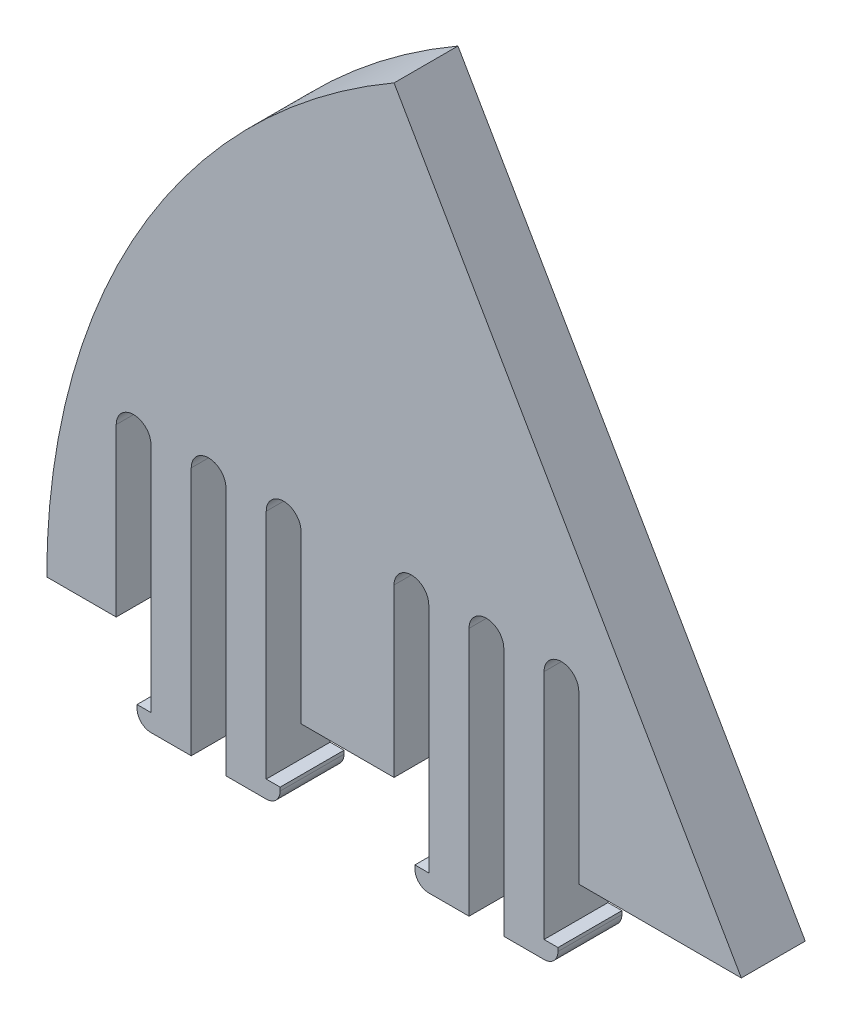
from build123d import *

# Parameters (mm, degrees)
BOSS_EXTRUDE1_DEPTH = 5.842


with BuildPart() as part:
    # Sketch1 → Boss-Extrude1 (new body)
    with BuildSketch(Plane.XY):
        with BuildLine():
            Line((0, 0), (-14.859, 0))
            Line((-14.859, 0), (-14.859, 15.24))
            ThreePointArc((-14.859, 15.24), (-16.4465, 16.8275), (-18.034, 15.24))
            Line((-18.034, 15.24), (-18.034, -5.969))
            Line((-18.034, -5.969), (-16.764, -5.969))
            Line((-16.764, -5.969), (-16.764, -6.2865))
            ThreePointArc((-16.764, -6.2865), (-17.135974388, -7.184525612), (-18.034, -7.5565))
            Line((-18.034, -7.5565), (-21.717, -7.5565))
            Line((-21.717, -7.5565), (-21.717, 15.24))
            ThreePointArc((-21.717, 15.24), (-23.3045, 16.8275), (-24.892, 15.24))
            Line((-24.892, 15.24), (-24.892, -7.5565))
            Line((-24.892, -7.5565), (-28.575, -7.5565))
            ThreePointArc((-28.575, -7.5565), (-29.473025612, -7.184525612), (-29.845, -6.2865))
            Line((-29.845, -6.2865), (-29.845, -5.969))
            Line((-29.845, -5.969), (-28.575, -5.969))
            Line((-28.575, -5.969), (-28.575, 15.24))
            ThreePointArc((-28.575, 15.24), (-30.1625, 16.8275), (-31.75, 15.24))
            Line((-31.75, 15.24), (-31.75, 0))
            Line((-31.75, 0), (-40.259, 0))
            Line((-40.259, 0), (-40.259, 15.24))
            ThreePointArc((-40.259, 15.24), (-41.8465, 16.8275), (-43.434, 15.24))
            Line((-43.434, 15.24), (-43.434, -5.969))
            Line((-43.434, -5.969), (-42.164, -5.969))
            Line((-42.164, -5.969), (-42.164, -6.2865))
            ThreePointArc((-42.164, -6.2865), (-42.535974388, -7.184525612), (-43.434, -7.5565))
            Line((-43.434, -7.5565), (-47.117, -7.5565))
            Line((-47.117, -7.5565), (-47.117, 15.24))
            ThreePointArc((-47.117, 15.24), (-48.7045, 16.8275), (-50.292, 15.24))
            Line((-50.292, 15.24), (-50.292, -7.5565))
            Line((-50.292, -7.5565), (-53.975, -7.5565))
            ThreePointArc((-53.975, -7.5565), (-54.873025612, -7.184525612), (-55.245, -6.2865))
            Line((-55.245, -6.2865), (-55.245, -5.969))
            Line((-55.245, -5.969), (-53.975, -5.969))
            Line((-53.975, -5.969), (-53.975, 15.24))
            ThreePointArc((-53.975, 15.24), (-55.5625, 16.8275), (-57.15, 15.24))
            Line((-57.15, 15.24), (-57.15, 0))
            Line((-57.15, 0), (-63.5, 0))
            ThreePointArc((-63.5, 0), (-54.99261314, 31.75), (-31.75, 54.99261314))
            Line((-31.75, 54.99261314), (0, 0))
        make_face()
    extrude(amount=BOSS_EXTRUDE1_DEPTH)


solid = part.part
